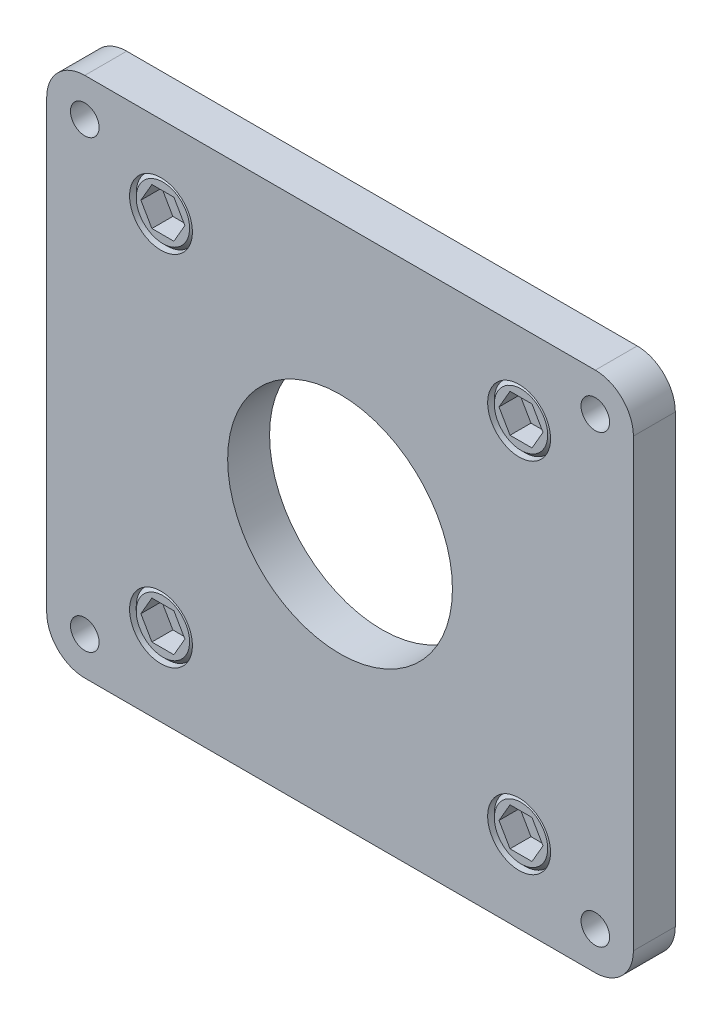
from build123d import *

# Parameters (mm, degrees)
SKETCH1_W              = 154
SKETCH1_H              = 137
SKETCH1_R              = 29.5
BASE_DEPTH             = 11
SKETCH5_R              = 8.25
SHCS_CUT_DEPTH         = 6.5
SKETCH6_R              = 8
SHCS_BOSS_DEPTH        = 6
SHCS_HEX_DEPTH         = 5.5
SHCS_CHAMFER_SIZE      = 1
FILLET1_R              = 10
SKETCH4_R              = 3.75
OUTERHOLES32_100_DEPTH = 104.64482621


with BuildPart() as part:
    # Sketch1 → Base (new body)
    with BuildSketch(Plane.XY):
        Rectangle(SKETCH1_W, SKETCH1_H)
        Circle(SKETCH1_R, mode=Mode.SUBTRACT)
    extrude(amount=BASE_DEPTH)

    # Sketch5 → SHCS-Cut (cut)
    with BuildSketch(Plane(origin=(-1.749253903, 13.535480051, 11), x_dir=(1, 0, 0), z_dir=(0, 0, 1))):
        with Locations((-45.250746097, 33.464519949)):
            Circle(SKETCH5_R)
        with Locations((48.749253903, 33.464519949)):
            Circle(SKETCH5_R)
        with Locations((48.749253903, -60.535480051)):
            Circle(SKETCH5_R)
        with Locations((-45.250746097, -60.535480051)):
            Circle(SKETCH5_R)
    extrude(amount=-SHCS_CUT_DEPTH, mode=Mode.SUBTRACT)

    # Sketch6 → SHCS-Boss (add)
    with BuildSketch(Plane(origin=(-1.749253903, 13.535480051, 4.5), x_dir=(1, 0, 0), z_dir=(0, 0, 1))):
        with Locations((-45.250746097, 33.464519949)):
            Circle(SKETCH6_R)
        with Locations(Location((48.749253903, 33.464519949, 0), (0, 0, 180))):
            Circle(SKETCH6_R)
        with Locations((48.749253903, -60.535480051)):
            Circle(SKETCH6_R)
        with Locations(Location((-45.250746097, -60.535480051, 0), (0, 0, 180))):
            Circle(SKETCH6_R)
    extrude(amount=SHCS_BOSS_DEPTH)

    # Sketch7 → SHCS-Hex (cut)
    with BuildSketch(Plane(origin=(-1.749253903, 13.535480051, 10.5), x_dir=(1, 0, 0), z_dir=(0, 0, 1))):
        Polygon((-42.363994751, 28.464519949), (-39.477243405, 33.464519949), (-42.363994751, 38.464519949), (-48.137497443, 38.464519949), (-51.024248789, 33.464519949), (-48.137497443, 28.464519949), align=None)
        Polygon((45.862502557, 38.464519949), (42.975751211, 33.464519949), (45.862502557, 28.464519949), (51.636005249, 28.464519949), (54.522756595, 33.464519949), (51.636005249, 38.464519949), align=None)
        Polygon((45.862502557, -55.535480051), (42.975751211, -60.535480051), (45.862502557, -65.535480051), (51.636005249, -65.535480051), (54.522756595, -60.535480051), (51.636005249, -55.535480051), align=None)
        Polygon((-48.137497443, -55.535480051), (-51.024248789, -60.535480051), (-48.137497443, -65.535480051), (-42.363994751, -65.535480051), (-39.477243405, -60.535480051), (-42.363994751, -55.535480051), align=None)
    extrude(amount=-SHCS_HEX_DEPTH, mode=Mode.SUBTRACT)

    # SHCS-Chamfer
    shcs_chamfer_edges = [part.edges().sort_by_distance(p)[0] for p in [
        (-55, 47, 10.5),
        (55, 47, 10.5),
        (39, -47, 10.5),
        (-39, -47, 10.5),
    ]]
    chamfer(shcs_chamfer_edges, length=SHCS_CHAMFER_SIZE)

    # Fillet1
    fillet1_edges = [part.edges().sort_by_distance(p)[0] for p in [
        (-77, 68.5, 5.5),
        (77, 68.5, 5.5),
        (77, -68.5, 5.5),
        (-77, -68.5, 5.5),
    ]]
    fillet(fillet1_edges, radius=FILLET1_R)

    # Sketch4 → OuterHoles32-100 (cut, through all)
    with BuildSketch(Plane.XY.offset(11)):
        with Locations((67, -58.5)):
            Circle(SKETCH4_R)
        with Locations(Location((67, 58.5, 0), (0, 0, 180))):
            Circle(SKETCH4_R)
        with Locations(Location((-67, -58.5, 0), (0, 0, 180))):
            Circle(SKETCH4_R)
        with Locations((-67, 58.5)):
            Circle(SKETCH4_R)
    extrude(amount=-OUTERHOLES32_100_DEPTH, mode=Mode.SUBTRACT)


solid = part.part
